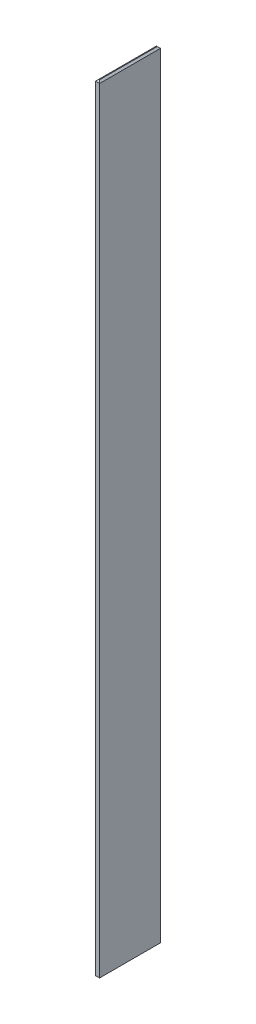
from build123d import *

# Parameters (mm, degrees)
SKETCH1_W           = 50.8
SKETCH1_H           = 762
BOSS_EXTRUDE1_DEPTH = 9739.6
CHAMFER1_SIZE       = 20


with BuildPart() as part:
    # Sketch1 → Boss-Extrude1 (new body)
    with BuildSketch(Plane(origin=(0, 0, 0), x_dir=(-1, 0, 0), z_dir=(0, 1, 0))):
        Rectangle(SKETCH1_W, SKETCH1_H)
    extrude(amount=BOSS_EXTRUDE1_DEPTH)

    # Chamfer1
    chamfer1_edges = [part.edges().sort_by_distance(p)[0] for p in [
        (25.4, 9739.6, 0),
        (0, 9739.6, -381),
        (-25.4, 9739.6, 0),
        (0, 0, -381),
        (25.4, 0, 0),
        (0, 0, 381),
        (-25.4, 0, 0),
        (0, 9739.6, 381),
    ]]
    chamfer(chamfer1_edges, length=CHAMFER1_SIZE)


solid = part.part
